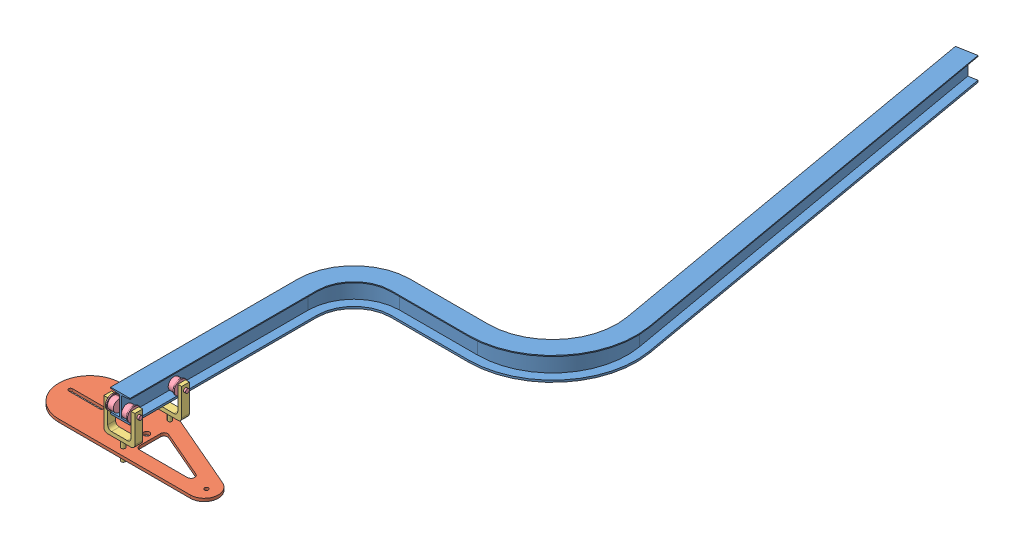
SolidWorks assembly Lesson7.SLDASM, configuration Default (file format 4100). Lengths in mm.
Overall size (968.93 199.9 2367.23).
9 component instances, 4 part files, 5 mates.
Components (placement in the parent):
- Rail-1: Rail.SLDPRT [Default] at origin size (711.2 76.2 2351.45)
- Carriage-1: Carriage.SLDASM [Default] at (-3.175 -120.523 -31.75) size (576.05 178.13 209.91)
  - Base Plate-1: Base Plate.SLDPRT [Default] at origin size (576.05 9.53 203.2)
  - Steerer-1: Steerer.SLDPRT [Default] at (0 34.925 -133.35) size (101.6 165.1 25.4)
  - Steerer-2: Steerer.SLDPRT [Default] at (0 34.925 19.05) size (101.6 165.1 25.4)
  - Wheels-1: Wheels.SLDPRT [Default] at (-32.385 120.523 -133.35) size (43.81 44.45 44.45)
  - Wheels-2: Wheels.SLDPRT [Default] at (-32.385 120.523 19.05) size (43.81 44.45 44.45)
  - Wheels-3: Wheels.SLDPRT [Default] at (32.385 120.523 -133.35) x (-1 0 0) z (0 -0.924225 -0.381849) size (43.81 44.45 44.45)
  - Wheels-4: Wheels.SLDPRT [Default] at (32.385 120.523 19.05) x (-1 0 0) z (0 -0.939858 0.341565) size (43.81 44.45 44.45)
Mates (geometry in assembly coordinates):
- Coincident1: coincident: plane of Rail-1 through (-31.75 50.8 0) normal (0 0 1); plane of ? through (-28.575 -60.198 -635) normal (0 0 1)
- Tangent1: tangent anti-aligned: plane of Rail-1 through (-31.75 -19.05 -609.6) normal (0 1 0); cylinder of Carriage-1/Wheels-1 through (-16.51 0 -165.1) axis (-1 0 0) radius 19.05
- Tangent2: tangent anti-aligned: plane of Rail-1 through (-31.75 -19.05 -609.6) normal (0 1 0); cylinder of Carriage-1/Wheels-2 through (-16.51 0 -12.7) axis (-1 0 0) radius 19.05
- Coincident2: coincident: plane of Rail-1 through (-3.175 -19.05 -609.6) normal (-1 0 0); point of Carriage-1/Base Plate-1
- Coincident3: coincident: plane of Rail-1 through (-3.175 -19.05 -609.6) normal (-1 0 0); unknown of Carriage-1/Base Plate-1
